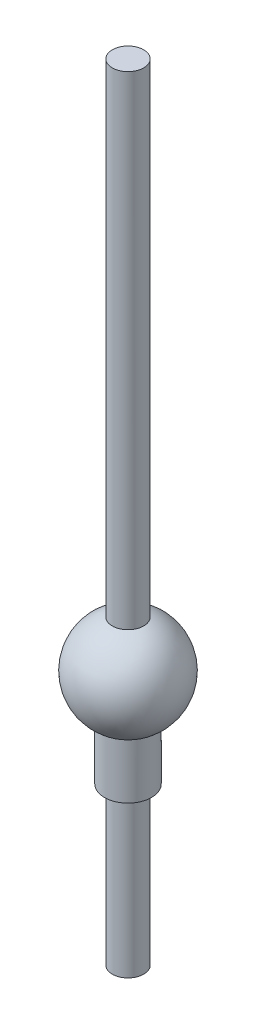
from build123d import *


with BuildPart() as part:
    # Sketch1 → Revolve1 (revolve)
    with BuildSketch(Plane.XY, mode=Mode.PRIVATE) as revolve1_sk:
        with BuildLine():
            Line((0, 0), (2, 0))
            Line((2, 0), (2, 20))
            Line((2, 20), (3, 20))
            Line((3, 20), (3, 27.01707195))
            ThreePointArc((3, 27.01707195), (6.226109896, 33.045944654), (2, 38.421359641))
            Line((2, 38.421359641), (2, 100))
            Line((2, 100), (0, 100))
            Line((0, 100), (0, 0))
        make_face()
    revolve(revolve1_sk.sketch.rotate(Axis((0, 0, 0), (0, 1, 0)), 90), axis=Axis((0, 0, 0), (0, 1, 0)))


solid = part.part
